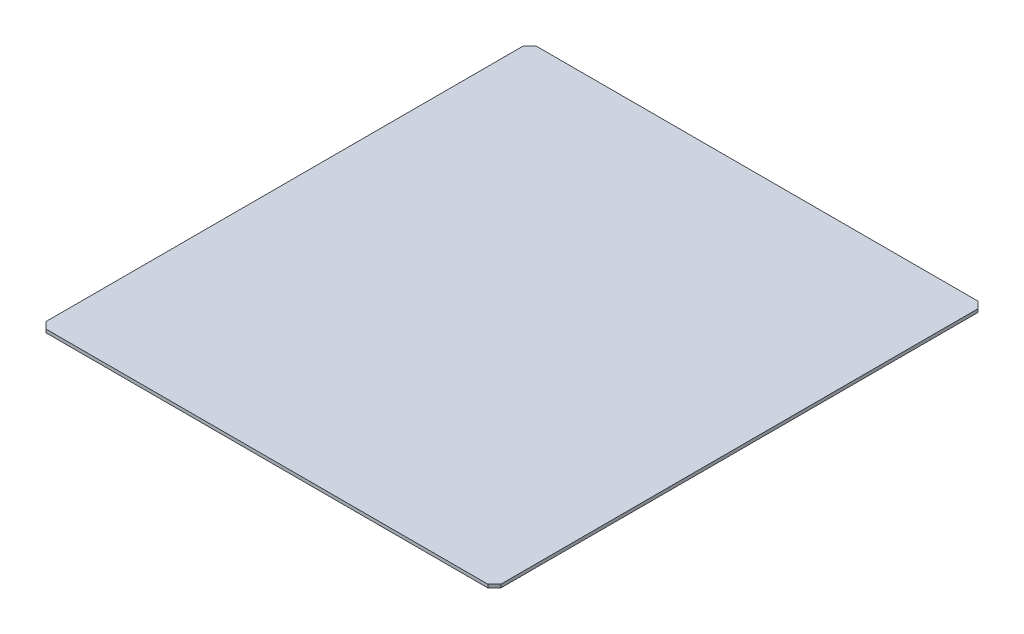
ISO-10303-21;
HEADER;
FILE_DESCRIPTION(('STEP AP214'),'2;1');
FILE_NAME('part.step','',(''),(''),'','','');
FILE_SCHEMA(('AUTOMOTIVE_DESIGN { 1 0 10303 214 1 1 1 1 }'));
ENDSEC;
DATA;
#1=APPLICATION_CONTEXT('core data for automotive mechanical design processes');
#2=APPLICATION_PROTOCOL_DEFINITION('international standard','automotive_design',2000,#1);
#3=PRODUCT_CONTEXT('',#1,'mechanical');
#4=PRODUCT('Part','Part','',(#3));
#5=PRODUCT_RELATED_PRODUCT_CATEGORY('part','',(#4));
#6=PRODUCT_DEFINITION_FORMATION('','',#4);
#7=PRODUCT_DEFINITION_CONTEXT('part definition',#1,'design');
#8=PRODUCT_DEFINITION('design','',#6,#7);
#9=PRODUCT_DEFINITION_SHAPE('','',#8);
#10=(LENGTH_UNIT() NAMED_UNIT(*) SI_UNIT(.MILLI.,.METRE.));
#11=(NAMED_UNIT(*) PLANE_ANGLE_UNIT() SI_UNIT($,.RADIAN.));
#12=(NAMED_UNIT(*) SI_UNIT($,.STERADIAN.) SOLID_ANGLE_UNIT());
#13=UNCERTAINTY_MEASURE_WITH_UNIT(LENGTH_MEASURE(1.E-05),#10,'distance_accuracy_value','');
#14=(GEOMETRIC_REPRESENTATION_CONTEXT(3) GLOBAL_UNCERTAINTY_ASSIGNED_CONTEXT((#13)) GLOBAL_UNIT_ASSIGNED_CONTEXT((#10,
#11,#12)) REPRESENTATION_CONTEXT('',''));
#15=CARTESIAN_POINT('',(0.,0.,0.));
#16=DIRECTION('',(0.,0.,1.));
#17=DIRECTION('',(1.,0.,0.));
#18=AXIS2_PLACEMENT_3D('',#15,#16,#17);
#19=CARTESIAN_POINT('',(60.,46.,100.));
#20=DIRECTION('',(1.,0.,0.));
#21=DIRECTION('',(0.,1.,0.));
#22=AXIS2_PLACEMENT_3D('',#19,#20,#21);
#23=PLANE('',#22);
#24=CARTESIAN_POINT('',(60.,-4.,10.));
#25=DIRECTION('',(1.,0.,0.));
#26=DIRECTION('',(0.,1.,0.));
#27=AXIS2_PLACEMENT_3D('',#24,#25,#26);
#28=CIRCLE('',#27,4.5);
#29=CARTESIAN_POINT('',(60.,0.499999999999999,10.));
#30=VERTEX_POINT('',#29);
#31=EDGE_CURVE('E205',#30,#30,#28,.T.);
#32=ORIENTED_EDGE('',*,*,#31,.T.);
#33=EDGE_LOOP('',(#32));
#34=FACE_BOUND('',#33,.T.);
#35=CARTESIAN_POINT('',(60.,-4.,90.));
#36=DIRECTION('',(1.,0.,0.));
#37=DIRECTION('',(0.,1.,0.));
#38=AXIS2_PLACEMENT_3D('',#35,#36,#37);
#39=CIRCLE('',#38,4.5);
#40=CARTESIAN_POINT('',(60.,0.500000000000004,90.));
#41=VERTEX_POINT('',#40);
#42=EDGE_CURVE('E152',#41,#41,#39,.T.);
#43=ORIENTED_EDGE('',*,*,#42,.T.);
#44=EDGE_LOOP('',(#43));
#45=FACE_BOUND('',#44,.T.);
#46=DIRECTION('',(0.,-1.,0.));
#47=VECTOR('',#46,1.);
#48=CARTESIAN_POINT('',(60.,46.,0.));
#49=LINE('',#48,#47);
#50=CARTESIAN_POINT('',(60.,46.,0.));
#51=VERTEX_POINT('',#50);
#52=CARTESIAN_POINT('',(60.,-50.,0.));
#53=VERTEX_POINT('',#52);
#54=EDGE_CURVE('E148',#51,#53,#49,.T.);
#55=ORIENTED_EDGE('',*,*,#54,.T.);
#56=DIRECTION('',(0.,0.,-1.));
#57=VECTOR('',#56,1.);
#58=CARTESIAN_POINT('',(60.,-50.,100.));
#59=LINE('',#58,#57);
#60=CARTESIAN_POINT('',(60.,-50.,100.));
#61=VERTEX_POINT('',#60);
#62=EDGE_CURVE('E11',#61,#53,#59,.T.);
#63=ORIENTED_EDGE('',*,*,#62,.F.);
#64=DIRECTION('',(0.,-1.,0.));
#65=VECTOR('',#64,1.);
#66=CARTESIAN_POINT('',(60.,46.,100.));
#67=LINE('',#66,#65);
#68=CARTESIAN_POINT('',(60.,46.,100.));
#69=VERTEX_POINT('',#68);
#70=EDGE_CURVE('E100',#69,#61,#67,.T.);
#71=ORIENTED_EDGE('',*,*,#70,.F.);
#72=DIRECTION('',(0.,0.,-1.));
#73=VECTOR('',#72,1.);
#74=CARTESIAN_POINT('',(60.,46.,100.));
#75=LINE('',#74,#73);
#76=EDGE_CURVE('E144',#69,#51,#75,.T.);
#77=ORIENTED_EDGE('',*,*,#76,.T.);
#78=EDGE_LOOP('',(#55,#63,#71,#77));
#79=FACE_BOUND('',#78,.T.);
#80=ADVANCED_FACE('F32',(#34,#45,#79),#23,.F.);
#81=CARTESIAN_POINT('',(64.,-50.,100.));
#82=DIRECTION('',(0.,-1.,0.));
#83=DIRECTION('',(0.,0.,-1.));
#84=AXIS2_PLACEMENT_3D('',#81,#82,#83);
#85=PLANE('',#84);
#86=DIRECTION('',(-1.,0.,0.));
#87=VECTOR('',#86,1.);
#88=CARTESIAN_POINT('',(64.,-50.,0.));
#89=LINE('',#88,#87);
#90=CARTESIAN_POINT('',(64.,-50.,0.));
#91=VERTEX_POINT('',#90);
#92=EDGE_CURVE('E151',#91,#53,#89,.T.);
#93=ORIENTED_EDGE('',*,*,#92,.F.);
#94=DIRECTION('',(0.,0.,-1.));
#95=VECTOR('',#94,1.);
#96=CARTESIAN_POINT('',(64.,-50.,100.));
#97=LINE('',#96,#95);
#98=CARTESIAN_POINT('',(64.,-50.,100.));
#99=VERTEX_POINT('',#98);
#100=EDGE_CURVE('E41',#99,#91,#97,.T.);
#101=ORIENTED_EDGE('',*,*,#100,.F.);
#102=DIRECTION('',(-1.,0.,0.));
#103=VECTOR('',#102,1.);
#104=CARTESIAN_POINT('',(64.,-50.,100.));
#105=LINE('',#104,#103);
#106=EDGE_CURVE('E211',#99,#61,#105,.T.);
#107=ORIENTED_EDGE('',*,*,#106,.T.);
#108=ORIENTED_EDGE('',*,*,#62,.T.);
#109=EDGE_LOOP('',(#93,#101,#107,#108));
#110=FACE_BOUND('',#109,.T.);
#111=ADVANCED_FACE('F258',(#110),#85,.T.);
#112=CARTESIAN_POINT('',(64.,46.,100.));
#113=DIRECTION('',(1.,0.,0.));
#114=DIRECTION('',(0.,1.,0.));
#115=AXIS2_PLACEMENT_3D('',#112,#113,#114);
#116=PLANE('',#115);
#117=CARTESIAN_POINT('',(64.,-4.,10.));
#118=DIRECTION('',(1.,0.,0.));
#119=DIRECTION('',(0.,1.,0.));
#120=AXIS2_PLACEMENT_3D('',#117,#118,#119);
#121=CIRCLE('',#120,4.5);
#122=CARTESIAN_POINT('',(64.,0.499999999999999,10.));
#123=VERTEX_POINT('',#122);
#124=EDGE_CURVE('E358',#123,#123,#121,.T.);
#125=ORIENTED_EDGE('',*,*,#124,.F.);
#126=EDGE_LOOP('',(#125));
#127=FACE_BOUND('',#126,.T.);
#128=CARTESIAN_POINT('',(64.,-4.,90.));
#129=DIRECTION('',(1.,0.,0.));
#130=DIRECTION('',(0.,1.,0.));
#131=AXIS2_PLACEMENT_3D('',#128,#129,#130);
#132=CIRCLE('',#131,4.5);
#133=CARTESIAN_POINT('',(64.,0.500000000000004,90.));
#134=VERTEX_POINT('',#133);
#135=EDGE_CURVE('E200',#134,#134,#132,.T.);
#136=ORIENTED_EDGE('',*,*,#135,.F.);
#137=EDGE_LOOP('',(#136));
#138=FACE_BOUND('',#137,.T.);
#139=DIRECTION('',(0.,-1.,0.));
#140=VECTOR('',#139,1.);
#141=CARTESIAN_POINT('',(64.,46.,0.));
#142=LINE('',#141,#140);
#143=CARTESIAN_POINT('',(64.,46.,0.));
#144=VERTEX_POINT('',#143);
#145=EDGE_CURVE('E155',#144,#91,#142,.T.);
#146=ORIENTED_EDGE('',*,*,#145,.F.);
#147=DIRECTION('',(0.,0.,-1.));
#148=VECTOR('',#147,1.);
#149=CARTESIAN_POINT('',(64.,46.,100.));
#150=LINE('',#149,#148);
#151=CARTESIAN_POINT('',(64.,46.,100.));
#152=VERTEX_POINT('',#151);
#153=EDGE_CURVE('E190',#152,#144,#150,.T.);
#154=ORIENTED_EDGE('',*,*,#153,.F.);
#155=DIRECTION('',(0.,-1.,0.));
#156=VECTOR('',#155,1.);
#157=CARTESIAN_POINT('',(64.,46.,100.));
#158=LINE('',#157,#156);
#159=EDGE_CURVE('E214',#152,#99,#158,.T.);
#160=ORIENTED_EDGE('',*,*,#159,.T.);
#161=ORIENTED_EDGE('',*,*,#100,.T.);
#162=EDGE_LOOP('',(#146,#154,#160,#161));
#163=FACE_BOUND('',#162,.T.);
#164=ADVANCED_FACE('F263',(#127,#138,#163),#116,.T.);
#165=CARTESIAN_POINT('',(56.,46.,100.));
#166=DIRECTION('',(0.,0.,-1.));
#167=DIRECTION('',(-1.,0.,0.));
#168=AXIS2_PLACEMENT_3D('',#165,#166,#167);
#169=CYLINDRICAL_SURFACE('',#168,8.);
#170=CARTESIAN_POINT('',(56.,46.,0.));
#171=DIRECTION('',(0.,0.,1.));
#172=DIRECTION('',(1.,0.,0.));
#173=AXIS2_PLACEMENT_3D('',#170,#171,#172);
#174=CIRCLE('',#173,8.);
#175=CARTESIAN_POINT('',(56.,54.,0.));
#176=VERTEX_POINT('',#175);
#177=EDGE_CURVE('E158',#176,#144,#174,.F.);
#178=ORIENTED_EDGE('',*,*,#177,.F.);
#179=DIRECTION('',(0.,0.,-1.));
#180=VECTOR('',#179,1.);
#181=CARTESIAN_POINT('',(56.,54.,100.));
#182=LINE('',#181,#180);
#183=CARTESIAN_POINT('',(56.,54.,100.));
#184=VERTEX_POINT('',#183);
#185=EDGE_CURVE('E187',#184,#176,#182,.T.);
#186=ORIENTED_EDGE('',*,*,#185,.F.);
#187=CARTESIAN_POINT('',(56.,46.,100.));
#188=DIRECTION('',(0.,0.,1.));
#189=DIRECTION('',(1.,0.,0.));
#190=AXIS2_PLACEMENT_3D('',#187,#188,#189);
#191=CIRCLE('',#190,8.);
#192=EDGE_CURVE('E217',#184,#152,#191,.F.);
#193=ORIENTED_EDGE('',*,*,#192,.T.);
#194=ORIENTED_EDGE('',*,*,#153,.T.);
#195=EDGE_LOOP('',(#178,#186,#193,#194));
#196=FACE_BOUND('',#195,.T.);
#197=ADVANCED_FACE('F277',(#196),#169,.T.);
#198=CARTESIAN_POINT('',(-56.,46.,100.));
#199=DIRECTION('',(0.,0.,-1.));
#200=DIRECTION('',(-1.,0.,0.));
#201=AXIS2_PLACEMENT_3D('',#198,#199,#200);
#202=CYLINDRICAL_SURFACE('',#201,8.);
#203=CARTESIAN_POINT('',(-56.,46.,0.));
#204=DIRECTION('',(0.,0.,1.));
#205=DIRECTION('',(1.,0.,0.));
#206=AXIS2_PLACEMENT_3D('',#203,#204,#205);
#207=CIRCLE('',#206,8.);
#208=CARTESIAN_POINT('',(-64.,46.,0.));
#209=VERTEX_POINT('',#208);
#210=CARTESIAN_POINT('',(-56.,54.,0.));
#211=VERTEX_POINT('',#210);
#212=EDGE_CURVE('E161',#209,#211,#207,.F.);
#213=ORIENTED_EDGE('',*,*,#212,.F.);
#214=DIRECTION('',(0.,0.,-1.));
#215=VECTOR('',#214,1.);
#216=CARTESIAN_POINT('',(-64.,46.,100.));
#217=LINE('',#216,#215);
#218=CARTESIAN_POINT('',(-64.,46.,100.));
#219=VERTEX_POINT('',#218);
#220=EDGE_CURVE('E182',#219,#209,#217,.T.);
#221=ORIENTED_EDGE('',*,*,#220,.F.);
#222=CARTESIAN_POINT('',(-56.,46.,100.));
#223=DIRECTION('',(0.,0.,1.));
#224=DIRECTION('',(1.,0.,0.));
#225=AXIS2_PLACEMENT_3D('',#222,#223,#224);
#226=CIRCLE('',#225,8.);
#227=CARTESIAN_POINT('',(-56.,54.,100.));
#228=VERTEX_POINT('',#227);
#229=EDGE_CURVE('E223',#219,#228,#226,.F.);
#230=ORIENTED_EDGE('',*,*,#229,.T.);
#231=DIRECTION('',(0.,0.,-1.));
#232=VECTOR('',#231,1.);
#233=CARTESIAN_POINT('',(-56.,54.,100.));
#234=LINE('',#233,#232);
#235=EDGE_CURVE('E184',#228,#211,#234,.T.);
#236=ORIENTED_EDGE('',*,*,#235,.T.);
#237=EDGE_LOOP('',(#213,#221,#230,#236));
#238=FACE_BOUND('',#237,.T.);
#239=ADVANCED_FACE('F443',(#238),#202,.T.);
#240=CARTESIAN_POINT('',(-64.,-50.,100.));
#241=DIRECTION('',(-1.,0.,0.));
#242=DIRECTION('',(0.,0.,1.));
#243=AXIS2_PLACEMENT_3D('',#240,#241,#242);
#244=PLANE('',#243);
#245=CARTESIAN_POINT('',(-64.,-4.00000000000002,10.));
#246=DIRECTION('',(1.,0.,0.));
#247=DIRECTION('',(0.,1.,0.));
#248=AXIS2_PLACEMENT_3D('',#245,#246,#247);
#249=CIRCLE('',#248,4.5);
#250=CARTESIAN_POINT('',(-64.,0.499999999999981,10.));
#251=VERTEX_POINT('',#250);
#252=EDGE_CURVE('E361',#251,#251,#249,.T.);
#253=ORIENTED_EDGE('',*,*,#252,.T.);
#254=EDGE_LOOP('',(#253));
#255=FACE_BOUND('',#254,.T.);
#256=CARTESIAN_POINT('',(-64.,-4.00000000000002,90.));
#257=DIRECTION('',(1.,0.,0.));
#258=DIRECTION('',(0.,1.,0.));
#259=AXIS2_PLACEMENT_3D('',#256,#257,#258);
#260=CIRCLE('',#259,4.5);
#261=CARTESIAN_POINT('',(-64.,0.499999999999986,90.));
#262=VERTEX_POINT('',#261);
#263=EDGE_CURVE('E194',#262,#262,#260,.T.);
#264=ORIENTED_EDGE('',*,*,#263,.T.);
#265=EDGE_LOOP('',(#264));
#266=FACE_BOUND('',#265,.T.);
#267=DIRECTION('',(0.,1.,0.));
#268=VECTOR('',#267,1.);
#269=CARTESIAN_POINT('',(-64.,-50.,0.));
#270=LINE('',#269,#268);
#271=CARTESIAN_POINT('',(-64.,-50.,0.));
#272=VERTEX_POINT('',#271);
#273=EDGE_CURVE('E164',#272,#209,#270,.T.);
#274=ORIENTED_EDGE('',*,*,#273,.F.);
#275=DIRECTION('',(0.,0.,-1.));
#276=VECTOR('',#275,1.);
#277=CARTESIAN_POINT('',(-64.,-50.,100.));
#278=LINE('',#277,#276);
#279=CARTESIAN_POINT('',(-64.,-50.,100.));
#280=VERTEX_POINT('',#279);
#281=EDGE_CURVE('E180',#280,#272,#278,.T.);
#282=ORIENTED_EDGE('',*,*,#281,.F.);
#283=DIRECTION('',(0.,1.,0.));
#284=VECTOR('',#283,1.);
#285=CARTESIAN_POINT('',(-64.,-50.,100.));
#286=LINE('',#285,#284);
#287=EDGE_CURVE('E226',#280,#219,#286,.T.);
#288=ORIENTED_EDGE('',*,*,#287,.T.);
#289=ORIENTED_EDGE('',*,*,#220,.T.);
#290=EDGE_LOOP('',(#274,#282,#288,#289));
#291=FACE_BOUND('',#290,.T.);
#292=ADVANCED_FACE('F239',(#255,#266,#291),#244,.T.);
#293=CARTESIAN_POINT('',(-60.,-50.,100.));
#294=DIRECTION('',(0.,-1.,0.));
#295=DIRECTION('',(0.,0.,-1.));
#296=AXIS2_PLACEMENT_3D('',#293,#294,#295);
#297=PLANE('',#296);
#298=DIRECTION('',(-1.,0.,0.));
#299=VECTOR('',#298,1.);
#300=CARTESIAN_POINT('',(-60.,-50.,0.));
#301=LINE('',#300,#299);
#302=CARTESIAN_POINT('',(-60.,-50.,0.));
#303=VERTEX_POINT('',#302);
#304=EDGE_CURVE('E167',#303,#272,#301,.T.);
#305=ORIENTED_EDGE('',*,*,#304,.F.);
#306=DIRECTION('',(0.,0.,-1.));
#307=VECTOR('',#306,1.);
#308=CARTESIAN_POINT('',(-60.,-50.,100.));
#309=LINE('',#308,#307);
#310=CARTESIAN_POINT('',(-60.,-50.,100.));
#311=VERTEX_POINT('',#310);
#312=EDGE_CURVE('E178',#311,#303,#309,.T.);
#313=ORIENTED_EDGE('',*,*,#312,.F.);
#314=DIRECTION('',(-1.,0.,0.));
#315=VECTOR('',#314,1.);
#316=CARTESIAN_POINT('',(-60.,-50.,100.));
#317=LINE('',#316,#315);
#318=EDGE_CURVE('E229',#311,#280,#317,.T.);
#319=ORIENTED_EDGE('',*,*,#318,.T.);
#320=ORIENTED_EDGE('',*,*,#281,.T.);
#321=EDGE_LOOP('',(#305,#313,#319,#320));
#322=FACE_BOUND('',#321,.T.);
#323=ADVANCED_FACE('F233',(#322),#297,.T.);
#324=CARTESIAN_POINT('',(-60.,-50.,100.));
#325=DIRECTION('',(-1.,0.,0.));
#326=DIRECTION('',(0.,0.,1.));
#327=AXIS2_PLACEMENT_3D('',#324,#325,#326);
#328=PLANE('',#327);
#329=CARTESIAN_POINT('',(-60.,-4.00000000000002,10.));
#330=DIRECTION('',(-1.,0.,0.));
#331=DIRECTION('',(0.,0.,1.));
#332=AXIS2_PLACEMENT_3D('',#329,#330,#331);
#333=CIRCLE('',#332,4.5);
#334=CARTESIAN_POINT('',(-60.,-4.00000000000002,14.5));
#335=VERTEX_POINT('',#334);
#336=EDGE_CURVE('E35',#335,#335,#333,.T.);
#337=ORIENTED_EDGE('',*,*,#336,.T.);
#338=EDGE_LOOP('',(#337));
#339=FACE_BOUND('',#338,.T.);
#340=CARTESIAN_POINT('',(-60.,-4.00000000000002,90.));
#341=DIRECTION('',(-1.,0.,0.));
#342=DIRECTION('',(0.,0.,1.));
#343=AXIS2_PLACEMENT_3D('',#340,#341,#342);
#344=CIRCLE('',#343,4.5);
#345=CARTESIAN_POINT('',(-60.,-4.00000000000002,94.5));
#346=VERTEX_POINT('',#345);
#347=EDGE_CURVE('E192',#346,#346,#344,.T.);
#348=ORIENTED_EDGE('',*,*,#347,.T.);
#349=EDGE_LOOP('',(#348));
#350=FACE_BOUND('',#349,.T.);
#351=DIRECTION('',(0.,1.,0.));
#352=VECTOR('',#351,1.);
#353=CARTESIAN_POINT('',(-60.,-50.,0.));
#354=LINE('',#353,#352);
#355=CARTESIAN_POINT('',(-60.,46.,0.));
#356=VERTEX_POINT('',#355);
#357=EDGE_CURVE('E170',#303,#356,#354,.T.);
#358=ORIENTED_EDGE('',*,*,#357,.T.);
#359=DIRECTION('',(0.,0.,-1.));
#360=VECTOR('',#359,1.);
#361=CARTESIAN_POINT('',(-60.,46.,100.));
#362=LINE('',#361,#360);
#363=CARTESIAN_POINT('',(-60.,46.,100.));
#364=VERTEX_POINT('',#363);
#365=EDGE_CURVE('E139',#364,#356,#362,.T.);
#366=ORIENTED_EDGE('',*,*,#365,.F.);
#367=DIRECTION('',(0.,1.,0.));
#368=VECTOR('',#367,1.);
#369=CARTESIAN_POINT('',(-60.,-50.,100.));
#370=LINE('',#369,#368);
#371=EDGE_CURVE('E130',#311,#364,#370,.T.);
#372=ORIENTED_EDGE('',*,*,#371,.F.);
#373=ORIENTED_EDGE('',*,*,#312,.T.);
#374=EDGE_LOOP('',(#358,#366,#372,#373));
#375=FACE_BOUND('',#374,.T.);
#376=ADVANCED_FACE('F246',(#339,#350,#375),#328,.F.);
#377=CARTESIAN_POINT('',(-56.,46.,100.));
#378=DIRECTION('',(0.,0.,-1.));
#379=DIRECTION('',(-1.,0.,0.));
#380=AXIS2_PLACEMENT_3D('',#377,#378,#379);
#381=CYLINDRICAL_SURFACE('',#380,4.);
#382=CARTESIAN_POINT('',(-56.,46.,0.));
#383=DIRECTION('',(0.,0.,-1.));
#384=DIRECTION('',(-1.,0.,0.));
#385=AXIS2_PLACEMENT_3D('',#382,#383,#384);
#386=CIRCLE('',#385,4.);
#387=CARTESIAN_POINT('',(-56.,50.,0.));
#388=VERTEX_POINT('',#387);
#389=EDGE_CURVE('E138',#356,#388,#386,.T.);
#390=ORIENTED_EDGE('',*,*,#389,.T.);
#391=DIRECTION('',(0.,0.,-1.));
#392=VECTOR('',#391,1.);
#393=CARTESIAN_POINT('',(-56.,50.,100.));
#394=LINE('',#393,#392);
#395=CARTESIAN_POINT('',(-56.,50.,100.));
#396=VERTEX_POINT('',#395);
#397=EDGE_CURVE('E135',#396,#388,#394,.T.);
#398=ORIENTED_EDGE('',*,*,#397,.F.);
#399=CARTESIAN_POINT('',(-56.,46.,100.));
#400=DIRECTION('',(0.,0.,-1.));
#401=DIRECTION('',(-1.,0.,0.));
#402=AXIS2_PLACEMENT_3D('',#399,#400,#401);
#403=CIRCLE('',#402,4.);
#404=EDGE_CURVE('E123',#364,#396,#403,.T.);
#405=ORIENTED_EDGE('',*,*,#404,.F.);
#406=ORIENTED_EDGE('',*,*,#365,.T.);
#407=EDGE_LOOP('',(#390,#398,#405,#406));
#408=FACE_BOUND('',#407,.T.);
#409=ADVANCED_FACE('F136',(#408),#381,.F.);
#410=CARTESIAN_POINT('',(-56.,50.,100.));
#411=DIRECTION('',(0.,1.,0.));
#412=DIRECTION('',(0.,0.,1.));
#413=AXIS2_PLACEMENT_3D('',#410,#411,#412);
#414=PLANE('',#413);
#415=DIRECTION('',(1.,0.,0.));
#416=VECTOR('',#415,1.);
#417=CARTESIAN_POINT('',(-56.,50.,0.));
#418=LINE('',#417,#416);
#419=CARTESIAN_POINT('',(56.,50.,0.));
#420=VERTEX_POINT('',#419);
#421=EDGE_CURVE('E88',#388,#420,#418,.T.);
#422=ORIENTED_EDGE('',*,*,#421,.T.);
#423=DIRECTION('',(0.,0.,-1.));
#424=VECTOR('',#423,1.);
#425=CARTESIAN_POINT('',(56.,50.,100.));
#426=LINE('',#425,#424);
#427=CARTESIAN_POINT('',(56.,50.,100.));
#428=VERTEX_POINT('',#427);
#429=EDGE_CURVE('E140',#428,#420,#426,.T.);
#430=ORIENTED_EDGE('',*,*,#429,.F.);
#431=DIRECTION('',(1.,0.,0.));
#432=VECTOR('',#431,1.);
#433=CARTESIAN_POINT('',(-56.,50.,100.));
#434=LINE('',#433,#432);
#435=EDGE_CURVE('E127',#396,#428,#434,.T.);
#436=ORIENTED_EDGE('',*,*,#435,.F.);
#437=ORIENTED_EDGE('',*,*,#397,.T.);
#438=EDGE_LOOP('',(#422,#430,#436,#437));
#439=FACE_BOUND('',#438,.T.);
#440=ADVANCED_FACE('F142',(#439),#414,.F.);
#441=CARTESIAN_POINT('',(56.,46.,100.));
#442=DIRECTION('',(0.,0.,-1.));
#443=DIRECTION('',(-1.,0.,0.));
#444=AXIS2_PLACEMENT_3D('',#441,#442,#443);
#445=CYLINDRICAL_SURFACE('',#444,4.);
#446=CARTESIAN_POINT('',(56.,46.,0.));
#447=DIRECTION('',(0.,0.,-1.));
#448=DIRECTION('',(-1.,0.,0.));
#449=AXIS2_PLACEMENT_3D('',#446,#447,#448);
#450=CIRCLE('',#449,4.);
#451=EDGE_CURVE('E94',#420,#51,#450,.T.);
#452=ORIENTED_EDGE('',*,*,#451,.T.);
#453=ORIENTED_EDGE('',*,*,#76,.F.);
#454=CARTESIAN_POINT('',(56.,46.,100.));
#455=DIRECTION('',(0.,0.,-1.));
#456=DIRECTION('',(-1.,0.,0.));
#457=AXIS2_PLACEMENT_3D('',#454,#455,#456);
#458=CIRCLE('',#457,4.);
#459=EDGE_CURVE('E50',#428,#69,#458,.T.);
#460=ORIENTED_EDGE('',*,*,#459,.F.);
#461=ORIENTED_EDGE('',*,*,#429,.T.);
#462=EDGE_LOOP('',(#452,#453,#460,#461));
#463=FACE_BOUND('',#462,.T.);
#464=ADVANCED_FACE('F390',(#463),#445,.F.);
#465=CARTESIAN_POINT('',(56.,46.,100.));
#466=DIRECTION('',(0.,0.,1.));
#467=DIRECTION('',(1.,0.,0.));
#468=AXIS2_PLACEMENT_3D('',#465,#466,#467);
#469=PLANE('',#468);
#470=ORIENTED_EDGE('',*,*,#70,.T.);
#471=ORIENTED_EDGE('',*,*,#106,.F.);
#472=ORIENTED_EDGE('',*,*,#159,.F.);
#473=ORIENTED_EDGE('',*,*,#192,.F.);
#474=DIRECTION('',(1.,0.,0.));
#475=VECTOR('',#474,1.);
#476=CARTESIAN_POINT('',(-56.,54.,100.));
#477=LINE('',#476,#475);
#478=EDGE_CURVE('E220',#228,#184,#477,.T.);
#479=ORIENTED_EDGE('',*,*,#478,.F.);
#480=ORIENTED_EDGE('',*,*,#229,.F.);
#481=ORIENTED_EDGE('',*,*,#287,.F.);
#482=ORIENTED_EDGE('',*,*,#318,.F.);
#483=ORIENTED_EDGE('',*,*,#371,.T.);
#484=ORIENTED_EDGE('',*,*,#404,.T.);
#485=ORIENTED_EDGE('',*,*,#435,.T.);
#486=ORIENTED_EDGE('',*,*,#459,.T.);
#487=EDGE_LOOP('',(#470,#471,#472,#473,#479,#480,#481,#482,#483,#484,#485,#486));
#488=FACE_BOUND('',#487,.T.);
#489=ADVANCED_FACE('F125',(#488),#469,.T.);
#490=CARTESIAN_POINT('',(56.,46.,0.));
#491=DIRECTION('',(0.,0.,1.));
#492=DIRECTION('',(1.,0.,0.));
#493=AXIS2_PLACEMENT_3D('',#490,#491,#492);
#494=PLANE('',#493);
#495=ORIENTED_EDGE('',*,*,#54,.F.);
#496=ORIENTED_EDGE('',*,*,#451,.F.);
#497=ORIENTED_EDGE('',*,*,#421,.F.);
#498=ORIENTED_EDGE('',*,*,#389,.F.);
#499=ORIENTED_EDGE('',*,*,#357,.F.);
#500=ORIENTED_EDGE('',*,*,#304,.T.);
#501=ORIENTED_EDGE('',*,*,#273,.T.);
#502=ORIENTED_EDGE('',*,*,#212,.T.);
#503=DIRECTION('',(-1.,0.,0.));
#504=VECTOR('',#503,1.);
#505=CARTESIAN_POINT('',(338.,54.,0.));
#506=LINE('',#505,#504);
#507=CARTESIAN_POINT('',(-338.,54.,0.));
#508=VERTEX_POINT('',#507);
#509=EDGE_CURVE('E356',#211,#508,#506,.T.);
#510=ORIENTED_EDGE('',*,*,#509,.T.);
#511=DIRECTION('',(0.,-1.,0.));
#512=VECTOR('',#511,1.);
#513=CARTESIAN_POINT('',(-338.,59.,0.));
#514=LINE('',#513,#512);
#515=CARTESIAN_POINT('',(-338.,59.,0.));
#516=VERTEX_POINT('',#515);
#517=EDGE_CURVE('E340',#516,#508,#514,.T.);
#518=ORIENTED_EDGE('',*,*,#517,.F.);
#519=DIRECTION('',(-1.,0.,0.));
#520=VECTOR('',#519,1.);
#521=CARTESIAN_POINT('',(338.,59.,0.));
#522=LINE('',#521,#520);
#523=CARTESIAN_POINT('',(338.,59.,0.));
#524=VERTEX_POINT('',#523);
#525=EDGE_CURVE('E346',#524,#516,#522,.T.);
#526=ORIENTED_EDGE('',*,*,#525,.F.);
#527=DIRECTION('',(0.,-1.,0.));
#528=VECTOR('',#527,1.);
#529=CARTESIAN_POINT('',(338.,59.,0.));
#530=LINE('',#529,#528);
#531=CARTESIAN_POINT('',(338.,54.,0.));
#532=VERTEX_POINT('',#531);
#533=EDGE_CURVE('E596',#524,#532,#530,.T.);
#534=ORIENTED_EDGE('',*,*,#533,.T.);
#535=EDGE_CURVE('E577',#532,#176,#506,.T.);
#536=ORIENTED_EDGE('',*,*,#535,.T.);
#537=ORIENTED_EDGE('',*,*,#177,.T.);
#538=ORIENTED_EDGE('',*,*,#145,.T.);
#539=ORIENTED_EDGE('',*,*,#92,.T.);
#540=EDGE_LOOP('',(#495,#496,#497,#498,#499,#500,#501,#502,#510,#518,#526,#534,#536,#537,#538,#539));
#541=FACE_BOUND('',#540,.T.);
#542=ADVANCED_FACE('F244',(#541),#494,.F.);
#543=CARTESIAN_POINT('',(-64.,-4.00000000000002,90.));
#544=DIRECTION('',(1.,0.,0.));
#545=DIRECTION('',(0.,1.,0.));
#546=AXIS2_PLACEMENT_3D('',#543,#544,#545);
#547=CYLINDRICAL_SURFACE('',#546,4.5);
#548=ORIENTED_EDGE('',*,*,#263,.F.);
#549=EDGE_LOOP('',(#548));
#550=FACE_BOUND('',#549,.T.);
#551=ORIENTED_EDGE('',*,*,#347,.F.);
#552=EDGE_LOOP('',(#551));
#553=FACE_BOUND('',#552,.T.);
#554=ADVANCED_FACE('F382',(#550,#553),#547,.F.);
#555=ORIENTED_EDGE('',*,*,#135,.T.);
#556=EDGE_LOOP('',(#555));
#557=FACE_BOUND('',#556,.T.);
#558=ORIENTED_EDGE('',*,*,#42,.F.);
#559=EDGE_LOOP('',(#558));
#560=FACE_BOUND('',#559,.T.);
#561=ADVANCED_FACE('F374',(#557,#560),#547,.F.);
#562=CARTESIAN_POINT('',(-64.,-4.00000000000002,10.));
#563=DIRECTION('',(1.,0.,0.));
#564=DIRECTION('',(0.,1.,0.));
#565=AXIS2_PLACEMENT_3D('',#562,#563,#564);
#566=CYLINDRICAL_SURFACE('',#565,4.5);
#567=ORIENTED_EDGE('',*,*,#252,.F.);
#568=EDGE_LOOP('',(#567));
#569=FACE_BOUND('',#568,.T.);
#570=ORIENTED_EDGE('',*,*,#336,.F.);
#571=EDGE_LOOP('',(#570));
#572=FACE_BOUND('',#571,.T.);
#573=ADVANCED_FACE('F371',(#569,#572),#566,.F.);
#574=ORIENTED_EDGE('',*,*,#124,.T.);
#575=EDGE_LOOP('',(#574));
#576=FACE_BOUND('',#575,.T.);
#577=ORIENTED_EDGE('',*,*,#31,.F.);
#578=EDGE_LOOP('',(#577));
#579=FACE_BOUND('',#578,.T.);
#580=ADVANCED_FACE('F373',(#576,#579),#566,.F.);
#581=CARTESIAN_POINT('',(-338.,59.,0.));
#582=DIRECTION('',(0.707106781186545,0.,0.70710678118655));
#583=DIRECTION('',(0.70710678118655,0.,-0.707106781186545));
#584=AXIS2_PLACEMENT_3D('',#581,#582,#583);
#585=PLANE('',#584);
#586=DIRECTION('',(-0.70710678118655,0.,0.707106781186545));
#587=VECTOR('',#586,1.);
#588=CARTESIAN_POINT('',(-338.,54.,0.));
#589=LINE('',#588,#587);
#590=CARTESIAN_POINT('',(-348.,54.,10.));
#591=VERTEX_POINT('',#590);
#592=EDGE_CURVE('E579',#508,#591,#589,.T.);
#593=ORIENTED_EDGE('',*,*,#592,.T.);
#594=DIRECTION('',(0.,-1.,0.));
#595=VECTOR('',#594,1.);
#596=CARTESIAN_POINT('',(-348.,59.,10.));
#597=LINE('',#596,#595);
#598=CARTESIAN_POINT('',(-348.,59.,10.));
#599=VERTEX_POINT('',#598);
#600=EDGE_CURVE('E342',#599,#591,#597,.T.);
#601=ORIENTED_EDGE('',*,*,#600,.F.);
#602=DIRECTION('',(-0.70710678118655,0.,0.707106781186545));
#603=VECTOR('',#602,1.);
#604=CARTESIAN_POINT('',(-338.,59.,0.));
#605=LINE('',#604,#603);
#606=EDGE_CURVE('E336',#516,#599,#605,.T.);
#607=ORIENTED_EDGE('',*,*,#606,.F.);
#608=ORIENTED_EDGE('',*,*,#517,.T.);
#609=EDGE_LOOP('',(#593,#601,#607,#608));
#610=FACE_BOUND('',#609,.T.);
#611=ADVANCED_FACE('F338',(#610),#585,.F.);
#612=CARTESIAN_POINT('',(-348.,59.,10.));
#613=DIRECTION('',(1.,0.,0.));
#614=DIRECTION('',(0.,0.,-1.));
#615=AXIS2_PLACEMENT_3D('',#612,#613,#614);
#616=PLANE('',#615);
#617=DIRECTION('',(0.,0.,1.));
#618=VECTOR('',#617,1.);
#619=CARTESIAN_POINT('',(-348.,54.,10.));
#620=LINE('',#619,#618);
#621=CARTESIAN_POINT('',(-348.,54.,740.));
#622=VERTEX_POINT('',#621);
#623=EDGE_CURVE('E581',#591,#622,#620,.T.);
#624=ORIENTED_EDGE('',*,*,#623,.T.);
#625=DIRECTION('',(0.,-1.,0.));
#626=VECTOR('',#625,1.);
#627=CARTESIAN_POINT('',(-348.,59.,740.));
#628=LINE('',#627,#626);
#629=CARTESIAN_POINT('',(-348.,59.,740.));
#630=VERTEX_POINT('',#629);
#631=EDGE_CURVE('E362',#630,#622,#628,.T.);
#632=ORIENTED_EDGE('',*,*,#631,.F.);
#633=DIRECTION('',(0.,0.,1.));
#634=VECTOR('',#633,1.);
#635=CARTESIAN_POINT('',(-348.,59.,10.));
#636=LINE('',#635,#634);
#637=EDGE_CURVE('E345',#599,#630,#636,.T.);
#638=ORIENTED_EDGE('',*,*,#637,.F.);
#639=ORIENTED_EDGE('',*,*,#600,.T.);
#640=EDGE_LOOP('',(#624,#632,#638,#639));
#641=FACE_BOUND('',#640,.T.);
#642=ADVANCED_FACE('F498',(#641),#616,.F.);
#643=CARTESIAN_POINT('',(-338.,59.,750.));
#644=DIRECTION('',(0.707106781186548,0.,-0.707106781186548));
#645=DIRECTION('',(-0.707106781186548,0.,-0.707106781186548));
#646=AXIS2_PLACEMENT_3D('',#643,#644,#645);
#647=PLANE('',#646);
#648=DIRECTION('',(0.707106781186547,0.,0.707106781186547));
#649=VECTOR('',#648,1.);
#650=CARTESIAN_POINT('',(-338.,54.,750.));
#651=LINE('',#650,#649);
#652=CARTESIAN_POINT('',(-338.,54.,750.));
#653=VERTEX_POINT('',#652);
#654=EDGE_CURVE('E587',#622,#653,#651,.T.);
#655=ORIENTED_EDGE('',*,*,#654,.T.);
#656=DIRECTION('',(0.,-1.,0.));
#657=VECTOR('',#656,1.);
#658=CARTESIAN_POINT('',(-338.,59.,750.));
#659=LINE('',#658,#657);
#660=CARTESIAN_POINT('',(-338.,59.,750.));
#661=VERTEX_POINT('',#660);
#662=EDGE_CURVE('E607',#661,#653,#659,.T.);
#663=ORIENTED_EDGE('',*,*,#662,.F.);
#664=DIRECTION('',(0.707106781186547,0.,0.707106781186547));
#665=VECTOR('',#664,1.);
#666=CARTESIAN_POINT('',(-338.,59.,750.));
#667=LINE('',#666,#665);
#668=EDGE_CURVE('E614',#630,#661,#667,.T.);
#669=ORIENTED_EDGE('',*,*,#668,.F.);
#670=ORIENTED_EDGE('',*,*,#631,.T.);
#671=EDGE_LOOP('',(#655,#663,#669,#670));
#672=FACE_BOUND('',#671,.T.);
#673=ADVANCED_FACE('F505',(#672),#647,.F.);
#674=CARTESIAN_POINT('',(338.,59.,750.));
#675=DIRECTION('',(0.,0.,-1.));
#676=DIRECTION('',(-1.,0.,0.));
#677=AXIS2_PLACEMENT_3D('',#674,#675,#676);
#678=PLANE('',#677);
#679=DIRECTION('',(1.,0.,0.));
#680=VECTOR('',#679,1.);
#681=CARTESIAN_POINT('',(338.,54.,750.));
#682=LINE('',#681,#680);
#683=CARTESIAN_POINT('',(338.,54.,750.));
#684=VERTEX_POINT('',#683);
#685=EDGE_CURVE('E589',#653,#684,#682,.T.);
#686=ORIENTED_EDGE('',*,*,#685,.T.);
#687=DIRECTION('',(0.,-1.,0.));
#688=VECTOR('',#687,1.);
#689=CARTESIAN_POINT('',(338.,59.,750.));
#690=LINE('',#689,#688);
#691=CARTESIAN_POINT('',(338.,59.,750.));
#692=VERTEX_POINT('',#691);
#693=EDGE_CURVE('E604',#692,#684,#690,.T.);
#694=ORIENTED_EDGE('',*,*,#693,.F.);
#695=DIRECTION('',(1.,0.,0.));
#696=VECTOR('',#695,1.);
#697=CARTESIAN_POINT('',(338.,59.,750.));
#698=LINE('',#697,#696);
#699=EDGE_CURVE('E625',#661,#692,#698,.T.);
#700=ORIENTED_EDGE('',*,*,#699,.F.);
#701=ORIENTED_EDGE('',*,*,#662,.T.);
#702=EDGE_LOOP('',(#686,#694,#700,#701));
#703=FACE_BOUND('',#702,.T.);
#704=ADVANCED_FACE('F513',(#703),#678,.F.);
#705=CARTESIAN_POINT('',(348.,59.,740.));
#706=DIRECTION('',(-0.707106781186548,0.,-0.707106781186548));
#707=DIRECTION('',(-0.707106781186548,0.,0.707106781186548));
#708=AXIS2_PLACEMENT_3D('',#705,#706,#707);
#709=PLANE('',#708);
#710=DIRECTION('',(0.707106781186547,0.,-0.707106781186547));
#711=VECTOR('',#710,1.);
#712=CARTESIAN_POINT('',(348.,54.,740.));
#713=LINE('',#712,#711);
#714=CARTESIAN_POINT('',(348.,54.,740.));
#715=VERTEX_POINT('',#714);
#716=EDGE_CURVE('E591',#684,#715,#713,.T.);
#717=ORIENTED_EDGE('',*,*,#716,.T.);
#718=DIRECTION('',(0.,-1.,0.));
#719=VECTOR('',#718,1.);
#720=CARTESIAN_POINT('',(348.,59.,740.));
#721=LINE('',#720,#719);
#722=CARTESIAN_POINT('',(348.,59.,740.));
#723=VERTEX_POINT('',#722);
#724=EDGE_CURVE('E601',#723,#715,#721,.T.);
#725=ORIENTED_EDGE('',*,*,#724,.F.);
#726=DIRECTION('',(0.707106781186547,0.,-0.707106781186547));
#727=VECTOR('',#726,1.);
#728=CARTESIAN_POINT('',(348.,59.,740.));
#729=LINE('',#728,#727);
#730=EDGE_CURVE('E622',#692,#723,#729,.T.);
#731=ORIENTED_EDGE('',*,*,#730,.F.);
#732=ORIENTED_EDGE('',*,*,#693,.T.);
#733=EDGE_LOOP('',(#717,#725,#731,#732));
#734=FACE_BOUND('',#733,.T.);
#735=ADVANCED_FACE('F522',(#734),#709,.F.);
#736=CARTESIAN_POINT('',(348.,59.,10.));
#737=DIRECTION('',(-1.,0.,0.));
#738=DIRECTION('',(0.,0.,1.));
#739=AXIS2_PLACEMENT_3D('',#736,#737,#738);
#740=PLANE('',#739);
#741=DIRECTION('',(0.,0.,-1.));
#742=VECTOR('',#741,1.);
#743=CARTESIAN_POINT('',(348.,54.,10.));
#744=LINE('',#743,#742);
#745=CARTESIAN_POINT('',(348.,54.,10.));
#746=VERTEX_POINT('',#745);
#747=EDGE_CURVE('E593',#715,#746,#744,.T.);
#748=ORIENTED_EDGE('',*,*,#747,.T.);
#749=DIRECTION('',(0.,-1.,0.));
#750=VECTOR('',#749,1.);
#751=CARTESIAN_POINT('',(348.,59.,10.));
#752=LINE('',#751,#750);
#753=CARTESIAN_POINT('',(348.,59.,10.));
#754=VERTEX_POINT('',#753);
#755=EDGE_CURVE('E598',#754,#746,#752,.T.);
#756=ORIENTED_EDGE('',*,*,#755,.F.);
#757=DIRECTION('',(0.,0.,-1.));
#758=VECTOR('',#757,1.);
#759=CARTESIAN_POINT('',(348.,59.,10.));
#760=LINE('',#759,#758);
#761=EDGE_CURVE('E624',#723,#754,#760,.T.);
#762=ORIENTED_EDGE('',*,*,#761,.F.);
#763=ORIENTED_EDGE('',*,*,#724,.T.);
#764=EDGE_LOOP('',(#748,#756,#762,#763));
#765=FACE_BOUND('',#764,.T.);
#766=ADVANCED_FACE('F531',(#765),#740,.F.);
#767=CARTESIAN_POINT('',(348.,59.,10.));
#768=DIRECTION('',(-0.707106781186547,0.,0.707106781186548));
#769=DIRECTION('',(0.707106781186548,0.,0.707106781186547));
#770=AXIS2_PLACEMENT_3D('',#767,#768,#769);
#771=PLANE('',#770);
#772=DIRECTION('',(-0.707106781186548,0.,-0.707106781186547));
#773=VECTOR('',#772,1.);
#774=CARTESIAN_POINT('',(348.,54.,10.));
#775=LINE('',#774,#773);
#776=EDGE_CURVE('E354',#746,#532,#775,.T.);
#777=ORIENTED_EDGE('',*,*,#776,.T.);
#778=ORIENTED_EDGE('',*,*,#533,.F.);
#779=DIRECTION('',(-0.707106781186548,0.,-0.707106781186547));
#780=VECTOR('',#779,1.);
#781=CARTESIAN_POINT('',(348.,59.,10.));
#782=LINE('',#781,#780);
#783=EDGE_CURVE('E351',#754,#524,#782,.T.);
#784=ORIENTED_EDGE('',*,*,#783,.F.);
#785=ORIENTED_EDGE('',*,*,#755,.T.);
#786=EDGE_LOOP('',(#777,#778,#784,#785));
#787=FACE_BOUND('',#786,.T.);
#788=ADVANCED_FACE('F540',(#787),#771,.F.);
#789=CARTESIAN_POINT('',(-348.,59.,0.));
#790=DIRECTION('',(0.,1.,0.));
#791=DIRECTION('',(0.,0.,1.));
#792=AXIS2_PLACEMENT_3D('',#789,#790,#791);
#793=PLANE('',#792);
#794=ORIENTED_EDGE('',*,*,#525,.T.);
#795=ORIENTED_EDGE('',*,*,#606,.T.);
#796=ORIENTED_EDGE('',*,*,#637,.T.);
#797=ORIENTED_EDGE('',*,*,#668,.T.);
#798=ORIENTED_EDGE('',*,*,#699,.T.);
#799=ORIENTED_EDGE('',*,*,#730,.T.);
#800=ORIENTED_EDGE('',*,*,#761,.T.);
#801=ORIENTED_EDGE('',*,*,#783,.T.);
#802=EDGE_LOOP('',(#794,#795,#796,#797,#798,#799,#800,#801));
#803=FACE_BOUND('',#802,.T.);
#804=ADVANCED_FACE('F349',(#803),#793,.T.);
#805=CARTESIAN_POINT('',(-348.,54.,0.));
#806=DIRECTION('',(0.,1.,0.));
#807=DIRECTION('',(0.,0.,1.));
#808=AXIS2_PLACEMENT_3D('',#805,#806,#807);
#809=PLANE('',#808);
#810=ORIENTED_EDGE('',*,*,#185,.T.);
#811=ORIENTED_EDGE('',*,*,#535,.F.);
#812=ORIENTED_EDGE('',*,*,#776,.F.);
#813=ORIENTED_EDGE('',*,*,#747,.F.);
#814=ORIENTED_EDGE('',*,*,#716,.F.);
#815=ORIENTED_EDGE('',*,*,#685,.F.);
#816=ORIENTED_EDGE('',*,*,#654,.F.);
#817=ORIENTED_EDGE('',*,*,#623,.F.);
#818=ORIENTED_EDGE('',*,*,#592,.F.);
#819=ORIENTED_EDGE('',*,*,#509,.F.);
#820=ORIENTED_EDGE('',*,*,#235,.F.);
#821=ORIENTED_EDGE('',*,*,#478,.T.);
#822=EDGE_LOOP('',(#810,#811,#812,#813,#814,#815,#816,#817,#818,#819,#820,#821));
#823=FACE_BOUND('',#822,.T.);
#824=ADVANCED_FACE('F557',(#823),#809,.F.);
#825=CLOSED_SHELL('',(#80,#111,#164,#197,#239,#292,#323,#376,#409,#440,#464,#489,#542,#554,#561,
#573,#580,#611,#642,#673,#704,#735,#766,#788,#804,#824));
#826=MANIFOLD_SOLID_BREP('B2',#825);
#827=ADVANCED_BREP_SHAPE_REPRESENTATION('',(#18,#826),#14);
#828=SHAPE_DEFINITION_REPRESENTATION(#9,#827);
ENDSEC;
END-ISO-10303-21;
